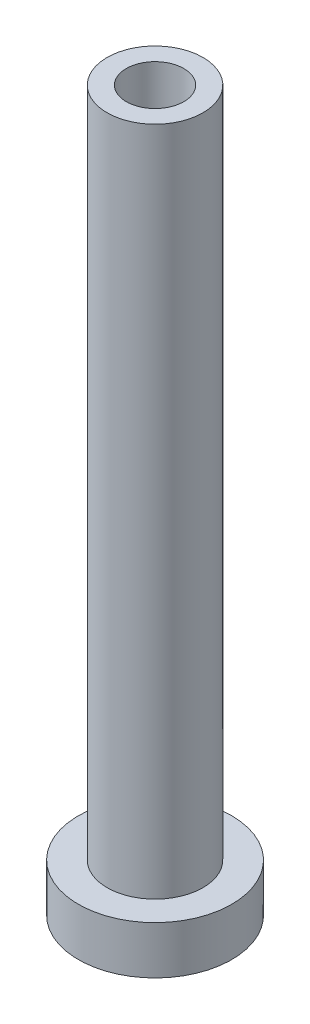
ISO-10303-21;
HEADER;
FILE_DESCRIPTION(('STEP AP214'),'2;1');
FILE_NAME('part.step','',(''),(''),'','','');
FILE_SCHEMA(('AUTOMOTIVE_DESIGN { 1 0 10303 214 1 1 1 1 }'));
ENDSEC;
DATA;
#1=APPLICATION_CONTEXT('core data for automotive mechanical design processes');
#2=APPLICATION_PROTOCOL_DEFINITION('international standard','automotive_design',2000,#1);
#3=PRODUCT_CONTEXT('',#1,'mechanical');
#4=PRODUCT('Part','Part','',(#3));
#5=PRODUCT_RELATED_PRODUCT_CATEGORY('part','',(#4));
#6=PRODUCT_DEFINITION_FORMATION('','',#4);
#7=PRODUCT_DEFINITION_CONTEXT('part definition',#1,'design');
#8=PRODUCT_DEFINITION('design','',#6,#7);
#9=PRODUCT_DEFINITION_SHAPE('','',#8);
#10=(LENGTH_UNIT() NAMED_UNIT(*) SI_UNIT(.MILLI.,.METRE.));
#11=(NAMED_UNIT(*) PLANE_ANGLE_UNIT() SI_UNIT($,.RADIAN.));
#12=(NAMED_UNIT(*) SI_UNIT($,.STERADIAN.) SOLID_ANGLE_UNIT());
#13=UNCERTAINTY_MEASURE_WITH_UNIT(LENGTH_MEASURE(1.E-05),#10,'distance_accuracy_value','');
#14=(GEOMETRIC_REPRESENTATION_CONTEXT(3) GLOBAL_UNCERTAINTY_ASSIGNED_CONTEXT((#13)) GLOBAL_UNIT_ASSIGNED_CONTEXT((#10,
#11,#12)) REPRESENTATION_CONTEXT('',''));
#15=CARTESIAN_POINT('',(0.,0.,0.));
#16=DIRECTION('',(0.,0.,1.));
#17=DIRECTION('',(1.,0.,0.));
#18=AXIS2_PLACEMENT_3D('',#15,#16,#17);
#19=CARTESIAN_POINT('',(0.,0.,0.));
#20=DIRECTION('',(0.,-1.,0.));
#21=DIRECTION('',(0.,0.,-1.));
#22=AXIS2_PLACEMENT_3D('',#19,#20,#21);
#23=CYLINDRICAL_SURFACE('',#22,8.);
#24=CARTESIAN_POINT('',(0.,-5.,0.));
#25=DIRECTION('',(0.,-1.,0.));
#26=DIRECTION('',(0.,0.,-1.));
#27=AXIS2_PLACEMENT_3D('',#24,#25,#26);
#28=CIRCLE('',#27,8.);
#29=CARTESIAN_POINT('',(0.,-5.,-8.));
#30=VERTEX_POINT('',#29);
#31=EDGE_CURVE('E41',#30,#30,#28,.T.);
#32=ORIENTED_EDGE('',*,*,#31,.F.);
#33=EDGE_LOOP('',(#32));
#34=FACE_BOUND('',#33,.T.);
#35=CARTESIAN_POINT('',(0.,0.,0.));
#36=DIRECTION('',(0.,-1.,0.));
#37=DIRECTION('',(0.,0.,-1.));
#38=AXIS2_PLACEMENT_3D('',#35,#36,#37);
#39=CIRCLE('',#38,8.);
#40=CARTESIAN_POINT('',(0.,0.,-8.));
#41=VERTEX_POINT('',#40);
#42=EDGE_CURVE('E8',#41,#41,#39,.T.);
#43=ORIENTED_EDGE('',*,*,#42,.T.);
#44=EDGE_LOOP('',(#43));
#45=FACE_BOUND('',#44,.T.);
#46=ADVANCED_FACE('F13',(#34,#45),#23,.T.);
#47=CARTESIAN_POINT('',(-8.,0.,0.));
#48=DIRECTION('',(0.,-1.,0.));
#49=DIRECTION('',(0.,0.,-1.));
#50=AXIS2_PLACEMENT_3D('',#47,#48,#49);
#51=PLANE('',#50);
#52=ORIENTED_EDGE('',*,*,#42,.F.);
#53=EDGE_LOOP('',(#52));
#54=FACE_BOUND('',#53,.T.);
#55=CARTESIAN_POINT('',(0.,0.,0.));
#56=DIRECTION('',(0.,-1.,0.));
#57=DIRECTION('',(0.,0.,-1.));
#58=AXIS2_PLACEMENT_3D('',#55,#56,#57);
#59=CIRCLE('',#58,5.);
#60=CARTESIAN_POINT('',(0.,0.,-5.));
#61=VERTEX_POINT('',#60);
#62=EDGE_CURVE('E19',#61,#61,#59,.T.);
#63=ORIENTED_EDGE('',*,*,#62,.T.);
#64=EDGE_LOOP('',(#63));
#65=FACE_BOUND('',#64,.T.);
#66=ADVANCED_FACE('F48',(#54,#65),#51,.F.);
#67=CARTESIAN_POINT('',(0.,0.,0.));
#68=DIRECTION('',(0.,-1.,0.));
#69=DIRECTION('',(0.,0.,-1.));
#70=AXIS2_PLACEMENT_3D('',#67,#68,#69);
#71=CYLINDRICAL_SURFACE('',#70,5.);
#72=ORIENTED_EDGE('',*,*,#62,.F.);
#73=EDGE_LOOP('',(#72));
#74=FACE_BOUND('',#73,.T.);
#75=CARTESIAN_POINT('',(0.,70.,0.));
#76=DIRECTION('',(0.,-1.,0.));
#77=DIRECTION('',(0.,0.,-1.));
#78=AXIS2_PLACEMENT_3D('',#75,#76,#77);
#79=CIRCLE('',#78,5.);
#80=CARTESIAN_POINT('',(0.,70.,-5.));
#81=VERTEX_POINT('',#80);
#82=EDGE_CURVE('E23',#81,#81,#79,.T.);
#83=ORIENTED_EDGE('',*,*,#82,.T.);
#84=EDGE_LOOP('',(#83));
#85=FACE_BOUND('',#84,.T.);
#86=ADVANCED_FACE('F54',(#74,#85),#71,.T.);
#87=CARTESIAN_POINT('',(-5.,70.,0.));
#88=DIRECTION('',(0.,-1.,0.));
#89=DIRECTION('',(0.,0.,-1.));
#90=AXIS2_PLACEMENT_3D('',#87,#88,#89);
#91=PLANE('',#90);
#92=ORIENTED_EDGE('',*,*,#82,.F.);
#93=EDGE_LOOP('',(#92));
#94=FACE_BOUND('',#93,.T.);
#95=CARTESIAN_POINT('',(0.,70.,0.));
#96=DIRECTION('',(0.,-1.,0.));
#97=DIRECTION('',(0.,0.,-1.));
#98=AXIS2_PLACEMENT_3D('',#95,#96,#97);
#99=CIRCLE('',#98,3.);
#100=CARTESIAN_POINT('',(0.,70.,-3.));
#101=VERTEX_POINT('',#100);
#102=EDGE_CURVE('E27',#101,#101,#99,.T.);
#103=ORIENTED_EDGE('',*,*,#102,.T.);
#104=EDGE_LOOP('',(#103));
#105=FACE_BOUND('',#104,.T.);
#106=ADVANCED_FACE('F60',(#94,#105),#91,.F.);
#107=CARTESIAN_POINT('',(0.,0.,0.));
#108=DIRECTION('',(0.,-1.,0.));
#109=DIRECTION('',(0.,0.,-1.));
#110=AXIS2_PLACEMENT_3D('',#107,#108,#109);
#111=CYLINDRICAL_SURFACE('',#110,3.);
#112=ORIENTED_EDGE('',*,*,#102,.F.);
#113=EDGE_LOOP('',(#112));
#114=FACE_BOUND('',#113,.T.);
#115=CARTESIAN_POINT('',(0.,25.,0.));
#116=DIRECTION('',(0.,-1.,0.));
#117=DIRECTION('',(0.,0.,-1.));
#118=AXIS2_PLACEMENT_3D('',#115,#116,#117);
#119=CIRCLE('',#118,2.99999999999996);
#120=CARTESIAN_POINT('',(0.,25.,-2.99999999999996));
#121=VERTEX_POINT('',#120);
#122=EDGE_CURVE('E32',#121,#121,#119,.T.);
#123=ORIENTED_EDGE('',*,*,#122,.T.);
#124=EDGE_LOOP('',(#123));
#125=FACE_BOUND('',#124,.T.);
#126=ADVANCED_FACE('F66',(#114,#125),#111,.F.);
#127=CARTESIAN_POINT('',(0.,24.75,0.));
#128=DIRECTION('',(0.,-1.,0.));
#129=DIRECTION('',(0.,0.,-1.));
#130=AXIS2_PLACEMENT_3D('',#127,#128,#129);
#131=CONICAL_SURFACE('',#130,3.25,0.785398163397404);
#132=ORIENTED_EDGE('',*,*,#122,.F.);
#133=EDGE_LOOP('',(#132));
#134=FACE_BOUND('',#133,.T.);
#135=CARTESIAN_POINT('',(0.,24.75,0.));
#136=DIRECTION('',(0.,-1.,0.));
#137=DIRECTION('',(0.,0.,-1.));
#138=AXIS2_PLACEMENT_3D('',#135,#136,#137);
#139=CIRCLE('',#138,3.25);
#140=CARTESIAN_POINT('',(0.,24.75,-3.25));
#141=VERTEX_POINT('',#140);
#142=EDGE_CURVE('E35',#141,#141,#139,.T.);
#143=ORIENTED_EDGE('',*,*,#142,.T.);
#144=EDGE_LOOP('',(#143));
#145=FACE_BOUND('',#144,.T.);
#146=ADVANCED_FACE('F70',(#134,#145),#131,.F.);
#147=CARTESIAN_POINT('',(0.,0.,0.));
#148=DIRECTION('',(0.,-1.,0.));
#149=DIRECTION('',(0.,0.,-1.));
#150=AXIS2_PLACEMENT_3D('',#147,#148,#149);
#151=CYLINDRICAL_SURFACE('',#150,3.25);
#152=ORIENTED_EDGE('',*,*,#142,.F.);
#153=EDGE_LOOP('',(#152));
#154=FACE_BOUND('',#153,.T.);
#155=CARTESIAN_POINT('',(0.,-5.,0.));
#156=DIRECTION('',(0.,-1.,0.));
#157=DIRECTION('',(0.,0.,-1.));
#158=AXIS2_PLACEMENT_3D('',#155,#156,#157);
#159=CIRCLE('',#158,3.25);
#160=CARTESIAN_POINT('',(0.,-5.,-3.25));
#161=VERTEX_POINT('',#160);
#162=EDGE_CURVE('E38',#161,#161,#159,.T.);
#163=ORIENTED_EDGE('',*,*,#162,.T.);
#164=EDGE_LOOP('',(#163));
#165=FACE_BOUND('',#164,.T.);
#166=ADVANCED_FACE('F74',(#154,#165),#151,.F.);
#167=CARTESIAN_POINT('',(-3.25,-5.,0.));
#168=DIRECTION('',(0.,1.,0.));
#169=DIRECTION('',(0.,0.,1.));
#170=AXIS2_PLACEMENT_3D('',#167,#168,#169);
#171=PLANE('',#170);
#172=ORIENTED_EDGE('',*,*,#162,.F.);
#173=EDGE_LOOP('',(#172));
#174=FACE_BOUND('',#173,.T.);
#175=ORIENTED_EDGE('',*,*,#31,.T.);
#176=EDGE_LOOP('',(#175));
#177=FACE_BOUND('',#176,.T.);
#178=ADVANCED_FACE('F45',(#174,#177),#171,.F.);
#179=CLOSED_SHELL('',(#46,#66,#86,#106,#126,#146,#166,#178));
#180=MANIFOLD_SOLID_BREP('B1',#179);
#181=ADVANCED_BREP_SHAPE_REPRESENTATION('',(#18,#180),#14);
#182=SHAPE_DEFINITION_REPRESENTATION(#9,#181);
ENDSEC;
END-ISO-10303-21;
